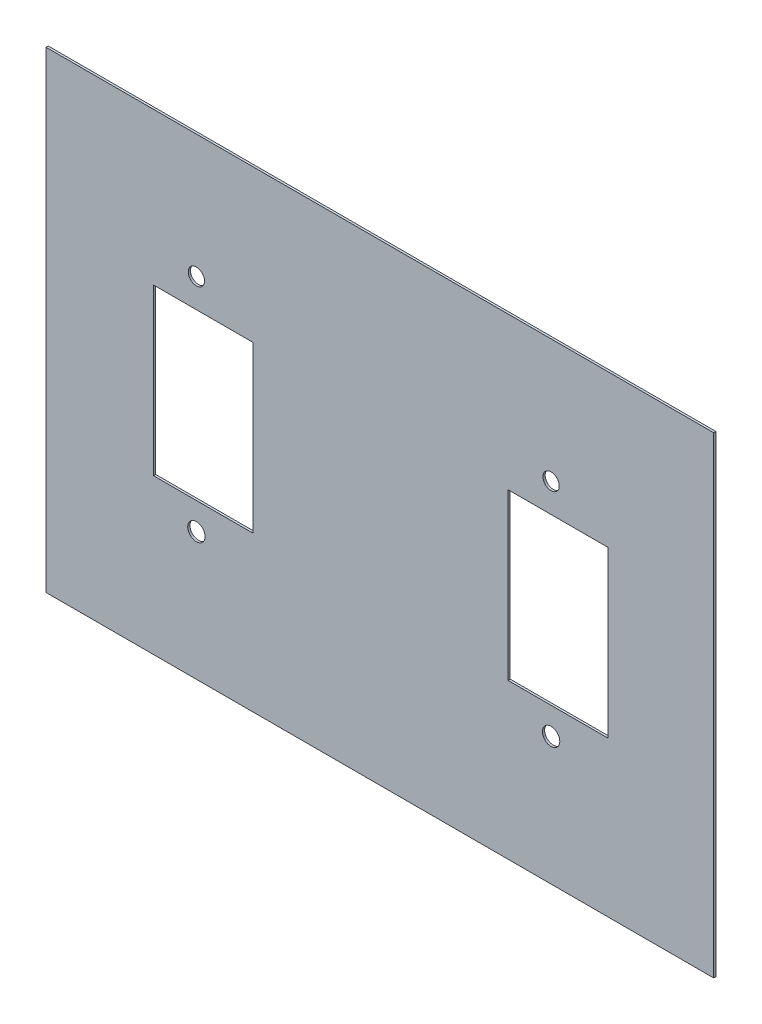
from build123d import *

# Parameters (mm, degrees)
SKETCH1_W               = 764.988234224
SKETCH1_H               = 1082.038199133
EXTRUDE1_DEPTH          = 2.54
SKETCH2_W               = 114.426220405
SKETCH2_H               = 189.282777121
CUT_EXTRUDE1_DEPTH      = 926.137834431
SKETCH3_R               = 9.334737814
SKETCH3_R_2             = 9.958839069
CUT_EXTRUDE2_DEPTH      = 926.137834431
LPATTERN1_COUNT         = 2
LPATTERN1_PITCH         = 762
LPATTERN1_COUNT_DIR2    = 3
LPATTERN1_PITCH_DIR2    = 203.2
CUT_EXTRUDE3_DEPTH      = 926.137834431
CUT_EXTRUDE3_DEPTH_BACK = 926.137834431


with BuildPart() as part:
    # Sketch1 → Extrude1 (new body)
    with BuildSketch(Plane.XY):
        with Locations((89.559503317, -254.618343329)):
            Rectangle(SKETCH1_W, SKETCH1_H)
    extrude(amount=EXTRUDE1_DEPTH)

    # Sketch2 → Cut-Extrude1 (cut, through all)
    with BuildSketch(Plane.XY.offset(2.54)):
        with Locations((-112.860629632, 17.455225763)):
            Rectangle(SKETCH2_W, SKETCH2_H)
    cut_extrude1 = extrude(amount=-CUT_EXTRUDE1_DEPTH, mode=Mode.SUBTRACT)

    # Sketch3 → Cut-Extrude2 (cut, through all)
    with BuildSketch(Plane.XY.offset(2.54)):
        with Locations((-120.68336915, 145.099046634)):
            Circle(SKETCH3_R)
        with Locations((-120.68336915, -108.095305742)):
            Circle(SKETCH3_R_2)
    cut_extrude2 = extrude(amount=-CUT_EXTRUDE2_DEPTH, mode=Mode.SUBTRACT)

    # LPattern1: Cut-Extrude1, Cut-Extrude2 2 × 3, 1 skipped
    with Locations(*[(j * LPATTERN1_PITCH_DIR2, -i * LPATTERN1_PITCH, 0) for i in range(LPATTERN1_COUNT) for j in range(LPATTERN1_COUNT_DIR2) if (i, j) not in ((0, 0), (0, 1))]):
        add(cut_extrude1, mode=Mode.SUBTRACT)
        add(cut_extrude2, mode=Mode.SUBTRACT)

    # Sketch4 → Cut-Extrude3 (cut, two sides: drawn at the far end of the back side and taken through both)
    with BuildSketch(Plane.XY.offset(2.54).offset(-CUT_EXTRUDE3_DEPTH_BACK)):
        Polygon((-2176.870220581, -254.618343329), (-292.934613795, -254.618343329), (472.053620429, -254.618343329), (2355.989227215, -254.618343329), (2355.989227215, -4022.489556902), (-2176.870220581, -4022.489556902), align=None)
    extrude(amount=CUT_EXTRUDE3_DEPTH + CUT_EXTRUDE3_DEPTH_BACK, mode=Mode.SUBTRACT)


solid = part.part
